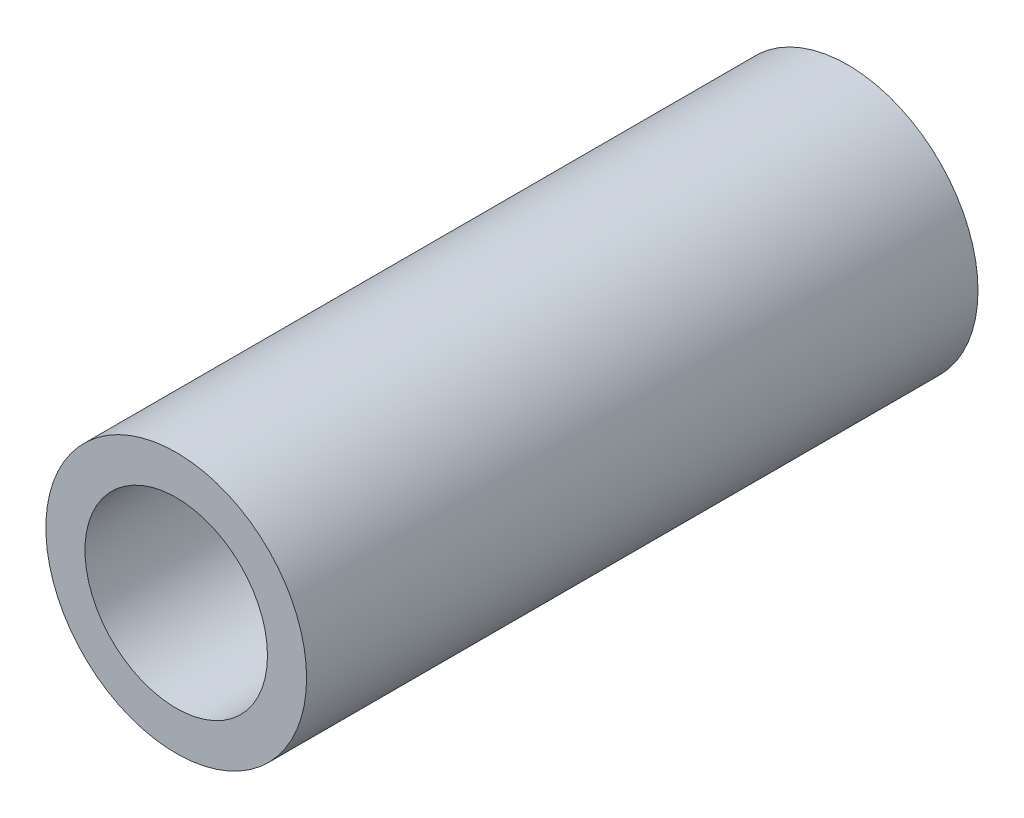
from build123d import *

# Parameters (mm, degrees)
SKETCH2_R           = 10.16
BOSS_EXTRUDE1_DEPTH = 52.324
SKETCH4_R           = 7.112
CUT_EXTRUDE2_DEPTH  = 50.8


with BuildPart() as part:
    # Sketch2 → Boss-Extrude1 (new body)
    with BuildSketch(Plane.XY):
        Circle(SKETCH2_R)
    extrude(amount=BOSS_EXTRUDE1_DEPTH)

    # Sketch4 → Cut-Extrude2 (cut)
    with BuildSketch(Plane.XY.offset(52.324)):
        Circle(SKETCH4_R)
    extrude(amount=-CUT_EXTRUDE2_DEPTH, mode=Mode.SUBTRACT)


solid = part.part
